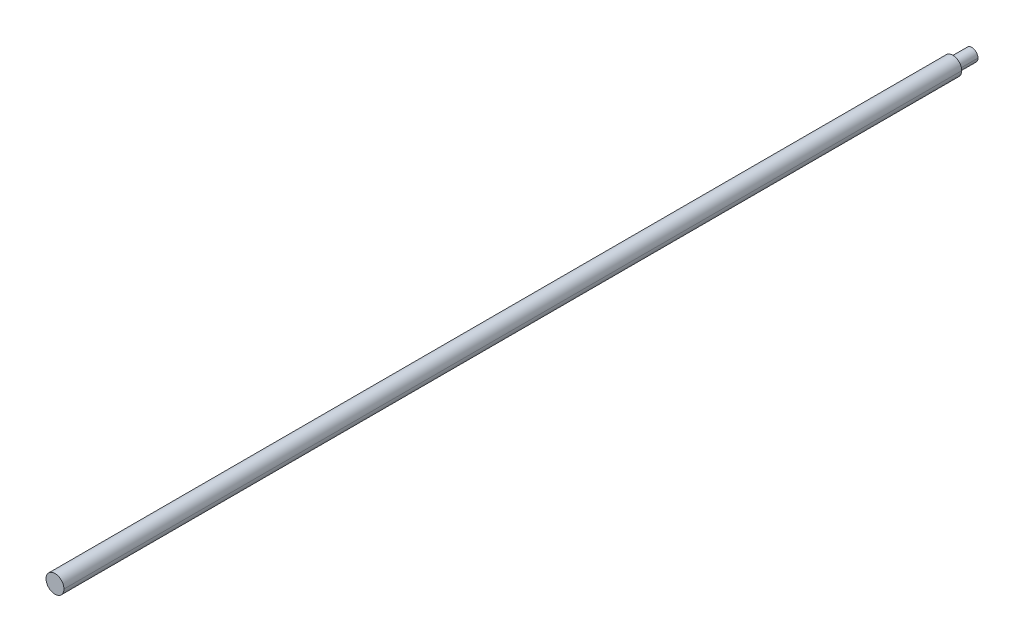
ISO-10303-21;
HEADER;
FILE_DESCRIPTION(('STEP AP214'),'2;1');
FILE_NAME('part.step','',(''),(''),'','','');
FILE_SCHEMA(('AUTOMOTIVE_DESIGN { 1 0 10303 214 1 1 1 1 }'));
ENDSEC;
DATA;
#1=APPLICATION_CONTEXT('core data for automotive mechanical design processes');
#2=APPLICATION_PROTOCOL_DEFINITION('international standard','automotive_design',2000,#1);
#3=PRODUCT_CONTEXT('',#1,'mechanical');
#4=PRODUCT('Part','Part','',(#3));
#5=PRODUCT_RELATED_PRODUCT_CATEGORY('part','',(#4));
#6=PRODUCT_DEFINITION_FORMATION('','',#4);
#7=PRODUCT_DEFINITION_CONTEXT('part definition',#1,'design');
#8=PRODUCT_DEFINITION('design','',#6,#7);
#9=PRODUCT_DEFINITION_SHAPE('','',#8);
#10=(LENGTH_UNIT() NAMED_UNIT(*) SI_UNIT(.MILLI.,.METRE.));
#11=(NAMED_UNIT(*) PLANE_ANGLE_UNIT() SI_UNIT($,.RADIAN.));
#12=(NAMED_UNIT(*) SI_UNIT($,.STERADIAN.) SOLID_ANGLE_UNIT());
#13=UNCERTAINTY_MEASURE_WITH_UNIT(LENGTH_MEASURE(1.E-05),#10,'distance_accuracy_value','');
#14=(GEOMETRIC_REPRESENTATION_CONTEXT(3) GLOBAL_UNCERTAINTY_ASSIGNED_CONTEXT((#13)) GLOBAL_UNIT_ASSIGNED_CONTEXT((#10,
#11,#12)) REPRESENTATION_CONTEXT('',''));
#15=CARTESIAN_POINT('',(0.,0.,0.));
#16=DIRECTION('',(0.,0.,1.));
#17=DIRECTION('',(1.,0.,0.));
#18=AXIS2_PLACEMENT_3D('',#15,#16,#17);
#19=CARTESIAN_POINT('',(0.,0.,-648.49375));
#20=DIRECTION('',(0.,0.,-1.));
#21=DIRECTION('',(-1.,0.,0.));
#22=AXIS2_PLACEMENT_3D('',#19,#20,#21);
#23=PLANE('',#22);
#24=CARTESIAN_POINT('',(0.,0.,-648.49375));
#25=DIRECTION('',(0.,0.,1.));
#26=DIRECTION('',(1.,0.,0.));
#27=AXIS2_PLACEMENT_3D('',#24,#25,#26);
#28=CIRCLE('',#27,8.73125);
#29=CARTESIAN_POINT('',(-8.73125,0.,-648.49375));
#30=VERTEX_POINT('',#29);
#31=CARTESIAN_POINT('',(8.73125,0.,-648.49375));
#32=VERTEX_POINT('',#31);
#33=EDGE_CURVE('E63',#30,#32,#28,.T.);
#34=ORIENTED_EDGE('',*,*,#33,.F.);
#35=CARTESIAN_POINT('',(0.,0.,-648.49375));
#36=DIRECTION('',(0.,0.,1.));
#37=DIRECTION('',(1.,0.,0.));
#38=AXIS2_PLACEMENT_3D('',#35,#36,#37);
#39=CIRCLE('',#38,8.73125);
#40=EDGE_CURVE('E19',#32,#30,#39,.T.);
#41=ORIENTED_EDGE('',*,*,#40,.F.);
#42=EDGE_LOOP('',(#34,#41));
#43=FACE_BOUND('',#42,.T.);
#44=ADVANCED_FACE('F16',(#43),#23,.T.);
#45=CARTESIAN_POINT('',(0.,0.,-635.));
#46=DIRECTION('',(0.,0.,1.));
#47=DIRECTION('',(1.,0.,0.));
#48=AXIS2_PLACEMENT_3D('',#45,#46,#47);
#49=CYLINDRICAL_SURFACE('',#48,8.73125);
#50=DIRECTION('',(0.,0.,1.));
#51=VECTOR('',#50,1.);
#52=CARTESIAN_POINT('',(-8.73125,0.,-635.));
#53=LINE('',#52,#51);
#54=CARTESIAN_POINT('',(-8.73125,0.,-621.50625));
#55=VERTEX_POINT('',#54);
#56=EDGE_CURVE('E58',#55,#30,#53,.F.);
#57=ORIENTED_EDGE('',*,*,#56,.F.);
#58=CARTESIAN_POINT('',(0.,0.,-621.50625));
#59=DIRECTION('',(0.,0.,1.));
#60=DIRECTION('',(1.,0.,0.));
#61=AXIS2_PLACEMENT_3D('',#58,#59,#60);
#62=CIRCLE('',#61,8.73125);
#63=CARTESIAN_POINT('',(8.73125,0.,-621.50625));
#64=VERTEX_POINT('',#63);
#65=EDGE_CURVE('E65',#64,#55,#62,.T.);
#66=ORIENTED_EDGE('',*,*,#65,.F.);
#67=DIRECTION('',(0.,0.,1.));
#68=VECTOR('',#67,1.);
#69=CARTESIAN_POINT('',(8.73125,0.,-635.));
#70=LINE('',#69,#68);
#71=EDGE_CURVE('E61',#32,#64,#70,.T.);
#72=ORIENTED_EDGE('',*,*,#71,.F.);
#73=ORIENTED_EDGE('',*,*,#40,.T.);
#74=EDGE_LOOP('',(#57,#66,#72,#73));
#75=FACE_BOUND('',#74,.T.);
#76=ADVANCED_FACE('F56',(#75),#49,.T.);
#77=CARTESIAN_POINT('',(0.,0.,-635.));
#78=DIRECTION('',(0.,0.,1.));
#79=DIRECTION('',(1.,0.,0.));
#80=AXIS2_PLACEMENT_3D('',#77,#78,#79);
#81=CYLINDRICAL_SURFACE('',#80,8.73125);
#82=ORIENTED_EDGE('',*,*,#56,.T.);
#83=ORIENTED_EDGE('',*,*,#33,.T.);
#84=ORIENTED_EDGE('',*,*,#71,.T.);
#85=CARTESIAN_POINT('',(0.,0.,-621.50625));
#86=DIRECTION('',(0.,0.,1.));
#87=DIRECTION('',(1.,0.,0.));
#88=AXIS2_PLACEMENT_3D('',#85,#86,#87);
#89=CIRCLE('',#88,8.73125);
#90=EDGE_CURVE('E68',#55,#64,#89,.T.);
#91=ORIENTED_EDGE('',*,*,#90,.F.);
#92=EDGE_LOOP('',(#82,#83,#84,#91));
#93=FACE_BOUND('',#92,.T.);
#94=ADVANCED_FACE('F66',(#93),#81,.T.);
#95=CARTESIAN_POINT('',(0.,0.,-621.50625));
#96=DIRECTION('',(0.,0.,-1.));
#97=DIRECTION('',(-1.,0.,0.));
#98=AXIS2_PLACEMENT_3D('',#95,#96,#97);
#99=PLANE('',#98);
#100=CARTESIAN_POINT('',(1.80477854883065E-13,0.,-621.50625));
#101=DIRECTION('',(0.,0.,1.));
#102=DIRECTION('',(1.,0.,0.));
#103=AXIS2_PLACEMENT_3D('',#100,#101,#102);
#104=CIRCLE('',#103,12.7);
#105=CARTESIAN_POINT('',(-12.6999999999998,0.,-621.50625));
#106=VERTEX_POINT('',#105);
#107=CARTESIAN_POINT('',(12.7000000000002,0.,-621.50625));
#108=VERTEX_POINT('',#107);
#109=EDGE_CURVE('E79',#106,#108,#104,.T.);
#110=ORIENTED_EDGE('',*,*,#109,.F.);
#111=CARTESIAN_POINT('',(1.80477854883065E-13,0.,-621.50625));
#112=DIRECTION('',(0.,0.,1.));
#113=DIRECTION('',(1.,0.,0.));
#114=AXIS2_PLACEMENT_3D('',#111,#112,#113);
#115=CIRCLE('',#114,12.7);
#116=EDGE_CURVE('E74',#108,#106,#115,.T.);
#117=ORIENTED_EDGE('',*,*,#116,.F.);
#118=EDGE_LOOP('',(#110,#117));
#119=FACE_BOUND('',#118,.T.);
#120=ORIENTED_EDGE('',*,*,#65,.T.);
#121=ORIENTED_EDGE('',*,*,#90,.T.);
#122=EDGE_LOOP('',(#120,#121));
#123=FACE_BOUND('',#122,.T.);
#124=ADVANCED_FACE('F83',(#119,#123),#99,.T.);
#125=CARTESIAN_POINT('',(0.,0.,13.49375));
#126=DIRECTION('',(0.,0.,1.));
#127=DIRECTION('',(1.,0.,0.));
#128=AXIS2_PLACEMENT_3D('',#125,#126,#127);
#129=CYLINDRICAL_SURFACE('',#128,12.7);
#130=DIRECTION('',(0.,0.,1.));
#131=VECTOR('',#130,1.);
#132=CARTESIAN_POINT('',(-12.7,0.,13.49375));
#133=LINE('',#132,#131);
#134=CARTESIAN_POINT('',(-12.7000000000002,0.,648.49375));
#135=VERTEX_POINT('',#134);
#136=EDGE_CURVE('E25',#106,#135,#133,.T.);
#137=ORIENTED_EDGE('',*,*,#136,.F.);
#138=ORIENTED_EDGE('',*,*,#109,.T.);
#139=DIRECTION('',(0.,0.,1.));
#140=VECTOR('',#139,1.);
#141=CARTESIAN_POINT('',(12.7,0.,13.49375));
#142=LINE('',#141,#140);
#143=CARTESIAN_POINT('',(12.6999999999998,0.,648.49375));
#144=VERTEX_POINT('',#143);
#145=EDGE_CURVE('E77',#144,#108,#142,.F.);
#146=ORIENTED_EDGE('',*,*,#145,.F.);
#147=CARTESIAN_POINT('',(-1.80477854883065E-13,0.,648.49375));
#148=DIRECTION('',(0.,0.,1.));
#149=DIRECTION('',(1.,0.,0.));
#150=AXIS2_PLACEMENT_3D('',#147,#148,#149);
#151=CIRCLE('',#150,12.7);
#152=EDGE_CURVE('E34',#135,#144,#151,.T.);
#153=ORIENTED_EDGE('',*,*,#152,.F.);
#154=EDGE_LOOP('',(#137,#138,#146,#153));
#155=FACE_BOUND('',#154,.T.);
#156=ADVANCED_FACE('F85',(#155),#129,.T.);
#157=CARTESIAN_POINT('',(0.,0.,648.49375));
#158=DIRECTION('',(0.,0.,1.));
#159=DIRECTION('',(0.,-1.,0.));
#160=AXIS2_PLACEMENT_3D('',#157,#158,#159);
#161=PLANE('',#160);
#162=CARTESIAN_POINT('',(-1.80477854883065E-13,0.,648.49375));
#163=DIRECTION('',(0.,0.,1.));
#164=DIRECTION('',(1.,0.,0.));
#165=AXIS2_PLACEMENT_3D('',#162,#163,#164);
#166=CIRCLE('',#165,12.7);
#167=EDGE_CURVE('E11',#135,#144,#166,.F.);
#168=ORIENTED_EDGE('',*,*,#167,.F.);
#169=ORIENTED_EDGE('',*,*,#152,.T.);
#170=EDGE_LOOP('',(#168,#169));
#171=FACE_BOUND('',#170,.T.);
#172=ADVANCED_FACE('F93',(#171),#161,.T.);
#173=CARTESIAN_POINT('',(0.,0.,13.49375));
#174=DIRECTION('',(0.,0.,1.));
#175=DIRECTION('',(1.,0.,0.));
#176=AXIS2_PLACEMENT_3D('',#173,#174,#175);
#177=CYLINDRICAL_SURFACE('',#176,12.7);
#178=ORIENTED_EDGE('',*,*,#136,.T.);
#179=ORIENTED_EDGE('',*,*,#167,.T.);
#180=ORIENTED_EDGE('',*,*,#145,.T.);
#181=ORIENTED_EDGE('',*,*,#116,.T.);
#182=EDGE_LOOP('',(#178,#179,#180,#181));
#183=FACE_BOUND('',#182,.T.);
#184=ADVANCED_FACE('F96',(#183),#177,.T.);
#185=CLOSED_SHELL('',(#44,#76,#94,#124,#156,#172,#184));
#186=MANIFOLD_SOLID_BREP('B1',#185);
#187=ADVANCED_BREP_SHAPE_REPRESENTATION('',(#18,#186),#14);
#188=SHAPE_DEFINITION_REPRESENTATION(#9,#187);
ENDSEC;
END-ISO-10303-21;
